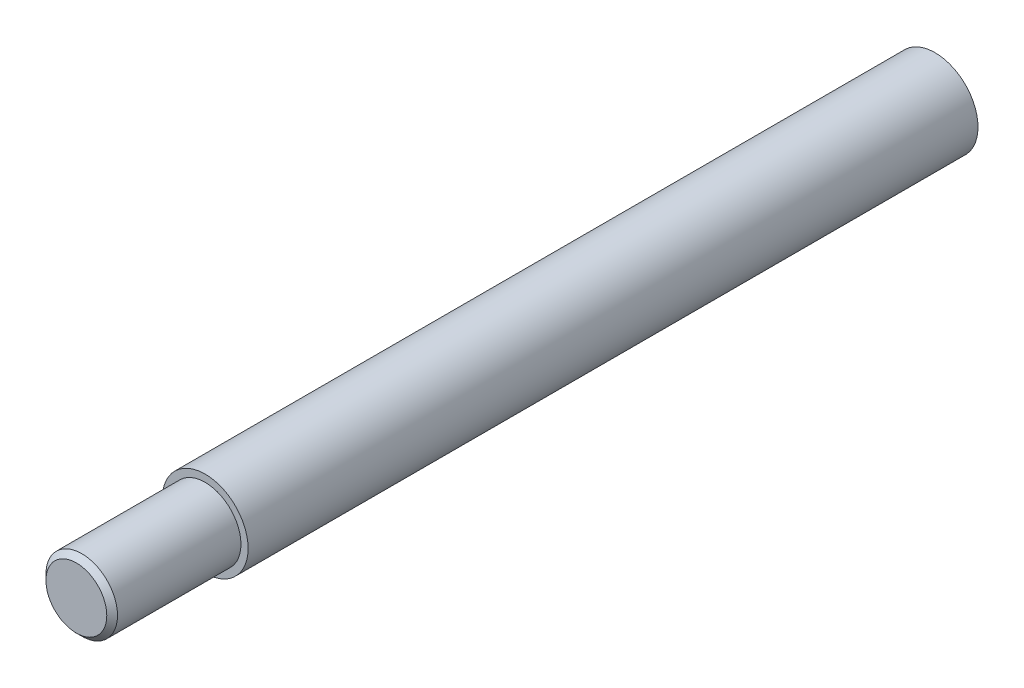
ISO-10303-21;
HEADER;
FILE_DESCRIPTION(('STEP AP214'),'2;1');
FILE_NAME('part.step','',(''),(''),'','','');
FILE_SCHEMA(('AUTOMOTIVE_DESIGN { 1 0 10303 214 1 1 1 1 }'));
ENDSEC;
DATA;
#1=APPLICATION_CONTEXT('core data for automotive mechanical design processes');
#2=APPLICATION_PROTOCOL_DEFINITION('international standard','automotive_design',2000,#1);
#3=PRODUCT_CONTEXT('',#1,'mechanical');
#4=PRODUCT('Part','Part','',(#3));
#5=PRODUCT_RELATED_PRODUCT_CATEGORY('part','',(#4));
#6=PRODUCT_DEFINITION_FORMATION('','',#4);
#7=PRODUCT_DEFINITION_CONTEXT('part definition',#1,'design');
#8=PRODUCT_DEFINITION('design','',#6,#7);
#9=PRODUCT_DEFINITION_SHAPE('','',#8);
#10=(LENGTH_UNIT() NAMED_UNIT(*) SI_UNIT(.MILLI.,.METRE.));
#11=(NAMED_UNIT(*) PLANE_ANGLE_UNIT() SI_UNIT($,.RADIAN.));
#12=(NAMED_UNIT(*) SI_UNIT($,.STERADIAN.) SOLID_ANGLE_UNIT());
#13=UNCERTAINTY_MEASURE_WITH_UNIT(LENGTH_MEASURE(1.E-05),#10,'distance_accuracy_value','');
#14=(GEOMETRIC_REPRESENTATION_CONTEXT(3) GLOBAL_UNCERTAINTY_ASSIGNED_CONTEXT((#13)) GLOBAL_UNIT_ASSIGNED_CONTEXT((#10,
#11,#12)) REPRESENTATION_CONTEXT('',''));
#15=CARTESIAN_POINT('',(0.,0.,0.));
#16=DIRECTION('',(0.,0.,1.));
#17=DIRECTION('',(1.,0.,0.));
#18=AXIS2_PLACEMENT_3D('',#15,#16,#17);
#19=CARTESIAN_POINT('',(0.,0.,120.));
#20=DIRECTION('',(0.,0.,-1.));
#21=DIRECTION('',(-1.,0.,0.));
#22=AXIS2_PLACEMENT_3D('',#19,#20,#21);
#23=CYLINDRICAL_SURFACE('',#22,6.);
#24=CARTESIAN_POINT('',(0.,0.,0.));
#25=DIRECTION('',(0.,0.,1.));
#26=DIRECTION('',(1.,0.,0.));
#27=AXIS2_PLACEMENT_3D('',#24,#25,#26);
#28=CIRCLE('',#27,6.);
#29=CARTESIAN_POINT('',(6.,0.,0.));
#30=VERTEX_POINT('',#29);
#31=EDGE_CURVE('E53',#30,#30,#28,.T.);
#32=ORIENTED_EDGE('',*,*,#31,.T.);
#33=EDGE_LOOP('',(#32));
#34=FACE_BOUND('',#33,.T.);
#35=CARTESIAN_POINT('',(0.,0.,102.));
#36=DIRECTION('',(0.,0.,1.));
#37=DIRECTION('',(1.,0.,0.));
#38=AXIS2_PLACEMENT_3D('',#35,#36,#37);
#39=CIRCLE('',#38,6.);
#40=CARTESIAN_POINT('',(6.,0.,102.));
#41=VERTEX_POINT('',#40);
#42=EDGE_CURVE('E58',#41,#41,#39,.T.);
#43=ORIENTED_EDGE('',*,*,#42,.F.);
#44=EDGE_LOOP('',(#43));
#45=FACE_BOUND('',#44,.T.);
#46=ADVANCED_FACE('F39',(#34,#45),#23,.T.);
#47=CARTESIAN_POINT('',(0.,0.,0.));
#48=DIRECTION('',(0.,0.,1.));
#49=DIRECTION('',(1.,0.,0.));
#50=AXIS2_PLACEMENT_3D('',#47,#48,#49);
#51=PLANE('',#50);
#52=ORIENTED_EDGE('',*,*,#31,.F.);
#53=EDGE_LOOP('',(#52));
#54=FACE_BOUND('',#53,.T.);
#55=ADVANCED_FACE('F73',(#54),#51,.F.);
#56=CARTESIAN_POINT('',(0.,0.,102.));
#57=DIRECTION('',(0.,0.,1.));
#58=DIRECTION('',(1.,0.,0.));
#59=AXIS2_PLACEMENT_3D('',#56,#57,#58);
#60=PLANE('',#59);
#61=CARTESIAN_POINT('',(0.,0.,102.));
#62=DIRECTION('',(0.,0.,1.));
#63=DIRECTION('',(1.,0.,0.));
#64=AXIS2_PLACEMENT_3D('',#61,#62,#63);
#65=CIRCLE('',#64,5.);
#66=CARTESIAN_POINT('',(5.,0.,102.));
#67=VERTEX_POINT('',#66);
#68=EDGE_CURVE('E63',#67,#67,#65,.T.);
#69=ORIENTED_EDGE('',*,*,#68,.F.);
#70=EDGE_LOOP('',(#69));
#71=FACE_BOUND('',#70,.T.);
#72=ORIENTED_EDGE('',*,*,#42,.T.);
#73=EDGE_LOOP('',(#72));
#74=FACE_BOUND('',#73,.T.);
#75=ADVANCED_FACE('F70',(#71,#74),#60,.T.);
#76=CARTESIAN_POINT('',(0.,0.,102.));
#77=DIRECTION('',(0.,0.,1.));
#78=DIRECTION('',(1.,0.,0.));
#79=AXIS2_PLACEMENT_3D('',#76,#77,#78);
#80=CYLINDRICAL_SURFACE('',#79,5.);
#81=CARTESIAN_POINT('',(0.,0.,119.25));
#82=DIRECTION('',(0.,0.,1.));
#83=DIRECTION('',(1.,0.,0.));
#84=AXIS2_PLACEMENT_3D('',#81,#82,#83);
#85=CIRCLE('',#84,5.);
#86=CARTESIAN_POINT('',(5.,0.,119.25));
#87=VERTEX_POINT('',#86);
#88=EDGE_CURVE('E11',#87,#87,#85,.F.);
#89=ORIENTED_EDGE('',*,*,#88,.T.);
#90=EDGE_LOOP('',(#89));
#91=FACE_BOUND('',#90,.T.);
#92=ORIENTED_EDGE('',*,*,#68,.T.);
#93=EDGE_LOOP('',(#92));
#94=FACE_BOUND('',#93,.T.);
#95=ADVANCED_FACE('F68',(#91,#94),#80,.T.);
#96=CARTESIAN_POINT('',(0.,0.,120.));
#97=DIRECTION('',(0.,0.,1.));
#98=DIRECTION('',(1.,0.,0.));
#99=AXIS2_PLACEMENT_3D('',#96,#97,#98);
#100=PLANE('',#99);
#101=CARTESIAN_POINT('',(0.,0.,120.));
#102=DIRECTION('',(0.,0.,1.));
#103=DIRECTION('',(1.,0.,0.));
#104=AXIS2_PLACEMENT_3D('',#101,#102,#103);
#105=CIRCLE('',#104,4.25);
#106=CARTESIAN_POINT('',(4.25,0.,120.));
#107=VERTEX_POINT('',#106);
#108=EDGE_CURVE('E47',#107,#107,#105,.T.);
#109=ORIENTED_EDGE('',*,*,#108,.T.);
#110=EDGE_LOOP('',(#109));
#111=FACE_BOUND('',#110,.T.);
#112=ADVANCED_FACE('F85',(#111),#100,.T.);
#113=CARTESIAN_POINT('',(0.,0.,120.));
#114=DIRECTION('',(0.,0.,-1.));
#115=DIRECTION('',(-1.,0.,0.));
#116=AXIS2_PLACEMENT_3D('',#113,#114,#115);
#117=CONICAL_SURFACE('',#116,4.25,0.785398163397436);
#118=ORIENTED_EDGE('',*,*,#88,.F.);
#119=EDGE_LOOP('',(#118));
#120=FACE_BOUND('',#119,.T.);
#121=ORIENTED_EDGE('',*,*,#108,.F.);
#122=EDGE_LOOP('',(#121));
#123=FACE_BOUND('',#122,.T.);
#124=ADVANCED_FACE('F41',(#120,#123),#117,.T.);
#125=CLOSED_SHELL('',(#46,#55,#75,#95,#112,#124));
#126=MANIFOLD_SOLID_BREP('B2',#125);
#127=ADVANCED_BREP_SHAPE_REPRESENTATION('',(#18,#126),#14);
#128=SHAPE_DEFINITION_REPRESENTATION(#9,#127);
ENDSEC;
END-ISO-10303-21;
